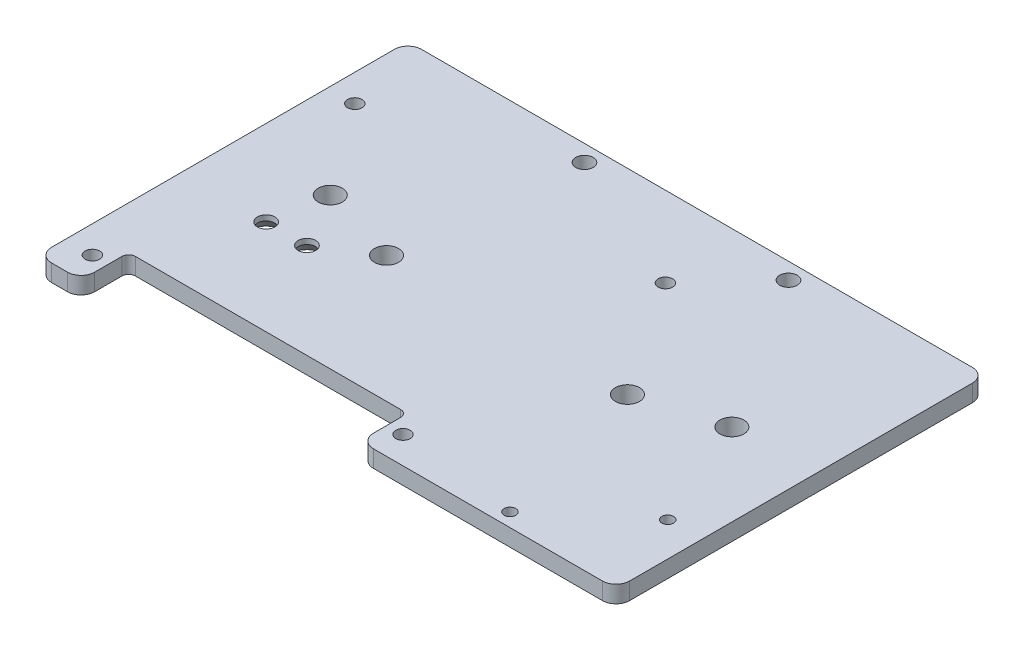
ISO-10303-21;
HEADER;
FILE_DESCRIPTION(('STEP AP214'),'2;1');
FILE_NAME('part.step','',(''),(''),'','','');
FILE_SCHEMA(('AUTOMOTIVE_DESIGN { 1 0 10303 214 1 1 1 1 }'));
ENDSEC;
DATA;
#1=APPLICATION_CONTEXT('core data for automotive mechanical design processes');
#2=APPLICATION_PROTOCOL_DEFINITION('international standard','automotive_design',2000,#1);
#3=PRODUCT_CONTEXT('',#1,'mechanical');
#4=PRODUCT('Part','Part','',(#3));
#5=PRODUCT_RELATED_PRODUCT_CATEGORY('part','',(#4));
#6=PRODUCT_DEFINITION_FORMATION('','',#4);
#7=PRODUCT_DEFINITION_CONTEXT('part definition',#1,'design');
#8=PRODUCT_DEFINITION('design','',#6,#7);
#9=PRODUCT_DEFINITION_SHAPE('','',#8);
#10=(LENGTH_UNIT() NAMED_UNIT(*) SI_UNIT(.MILLI.,.METRE.));
#11=(NAMED_UNIT(*) PLANE_ANGLE_UNIT() SI_UNIT($,.RADIAN.));
#12=(NAMED_UNIT(*) SI_UNIT($,.STERADIAN.) SOLID_ANGLE_UNIT());
#13=UNCERTAINTY_MEASURE_WITH_UNIT(LENGTH_MEASURE(1.E-05),#10,'distance_accuracy_value','');
#14=(GEOMETRIC_REPRESENTATION_CONTEXT(3) GLOBAL_UNCERTAINTY_ASSIGNED_CONTEXT((#13)) GLOBAL_UNIT_ASSIGNED_CONTEXT((#10,
#11,#12)) REPRESENTATION_CONTEXT('',''));
#15=CARTESIAN_POINT('',(0.,0.,0.));
#16=DIRECTION('',(0.,0.,1.));
#17=DIRECTION('',(1.,0.,0.));
#18=AXIS2_PLACEMENT_3D('',#15,#16,#17);
#19=CARTESIAN_POINT('',(5.5049928,3.175,-2.54));
#20=DIRECTION('',(0.,-1.,0.));
#21=DIRECTION('',(0.,0.,-1.));
#22=AXIS2_PLACEMENT_3D('',#19,#20,#21);
#23=CYLINDRICAL_SURFACE('',#22,2.54);
#24=DIRECTION('',(0.,-1.,0.));
#25=VECTOR('',#24,1.);
#26=CARTESIAN_POINT('',(8.0449928,3.175,-2.54));
#27=LINE('',#26,#25);
#28=CARTESIAN_POINT('',(8.0449928,3.175,-2.54));
#29=VERTEX_POINT('',#28);
#30=CARTESIAN_POINT('',(8.0449928,0.,-2.54));
#31=VERTEX_POINT('',#30);
#32=EDGE_CURVE('E289',#29,#31,#27,.T.);
#33=ORIENTED_EDGE('',*,*,#32,.F.);
#34=CARTESIAN_POINT('',(5.5049928,3.175,-2.54));
#35=DIRECTION('',(0.,-1.,0.));
#36=DIRECTION('',(0.,0.,-1.));
#37=AXIS2_PLACEMENT_3D('',#34,#35,#36);
#38=CIRCLE('',#37,2.54);
#39=CARTESIAN_POINT('',(5.5049928,3.175,0.));
#40=VERTEX_POINT('',#39);
#41=EDGE_CURVE('E55',#40,#29,#38,.F.);
#42=ORIENTED_EDGE('',*,*,#41,.F.);
#43=DIRECTION('',(0.,-1.,0.));
#44=VECTOR('',#43,1.);
#45=CARTESIAN_POINT('',(5.5049928,3.175,0.));
#46=LINE('',#45,#44);
#47=CARTESIAN_POINT('',(5.5049928,0.,0.));
#48=VERTEX_POINT('',#47);
#49=EDGE_CURVE('E293',#48,#40,#46,.F.);
#50=ORIENTED_EDGE('',*,*,#49,.F.);
#51=CARTESIAN_POINT('',(5.5049928,0.,-2.54));
#52=DIRECTION('',(0.,-1.,0.));
#53=DIRECTION('',(0.,0.,-1.));
#54=AXIS2_PLACEMENT_3D('',#51,#52,#53);
#55=CIRCLE('',#54,2.54);
#56=EDGE_CURVE('E11',#31,#48,#55,.T.);
#57=ORIENTED_EDGE('',*,*,#56,.F.);
#58=EDGE_LOOP('',(#33,#42,#50,#57));
#59=FACE_BOUND('',#58,.T.);
#60=ADVANCED_FACE('F47',(#59),#23,.T.);
#61=CARTESIAN_POINT('',(9.3149928,3.175,-7.62));
#62=DIRECTION('',(0.,1.,0.));
#63=DIRECTION('',(0.,0.,1.));
#64=AXIS2_PLACEMENT_3D('',#61,#62,#63);
#65=CYLINDRICAL_SURFACE('',#64,1.27);
#66=DIRECTION('',(0.,-1.,0.));
#67=VECTOR('',#66,1.);
#68=CARTESIAN_POINT('',(9.3149928,3.175,-8.89));
#69=LINE('',#68,#67);
#70=CARTESIAN_POINT('',(9.3149928,3.175,-8.89));
#71=VERTEX_POINT('',#70);
#72=CARTESIAN_POINT('',(9.3149928,0.,-8.89));
#73=VERTEX_POINT('',#72);
#74=EDGE_CURVE('E274',#71,#73,#69,.T.);
#75=ORIENTED_EDGE('',*,*,#74,.F.);
#76=CARTESIAN_POINT('',(9.3149928,3.175,-7.62));
#77=DIRECTION('',(0.,-1.,0.));
#78=DIRECTION('',(0.,0.,-1.));
#79=AXIS2_PLACEMENT_3D('',#76,#77,#78);
#80=CIRCLE('',#79,1.27);
#81=CARTESIAN_POINT('',(8.0449928,3.175,-7.62));
#82=VERTEX_POINT('',#81);
#83=EDGE_CURVE('E282',#71,#82,#80,.F.);
#84=ORIENTED_EDGE('',*,*,#83,.T.);
#85=DIRECTION('',(0.,-1.,0.));
#86=VECTOR('',#85,1.);
#87=CARTESIAN_POINT('',(8.0449928,3.175,-7.62));
#88=LINE('',#87,#86);
#89=CARTESIAN_POINT('',(8.0449928,0.,-7.62));
#90=VERTEX_POINT('',#89);
#91=EDGE_CURVE('E278',#90,#82,#88,.F.);
#92=ORIENTED_EDGE('',*,*,#91,.F.);
#93=CARTESIAN_POINT('',(9.3149928,0.,-7.62));
#94=DIRECTION('',(0.,-1.,0.));
#95=DIRECTION('',(0.,0.,-1.));
#96=AXIS2_PLACEMENT_3D('',#93,#94,#95);
#97=CIRCLE('',#96,1.27);
#98=EDGE_CURVE('E286',#90,#73,#97,.T.);
#99=ORIENTED_EDGE('',*,*,#98,.T.);
#100=EDGE_LOOP('',(#75,#84,#92,#99));
#101=FACE_BOUND('',#100,.T.);
#102=ADVANCED_FACE('F619',(#101),#65,.F.);
#103=CARTESIAN_POINT('',(58.845007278,3.175,-7.62));
#104=DIRECTION('',(0.,1.,0.));
#105=DIRECTION('',(0.,0.,1.));
#106=AXIS2_PLACEMENT_3D('',#103,#104,#105);
#107=CYLINDRICAL_SURFACE('',#106,1.27);
#108=DIRECTION('',(0.,-1.,0.));
#109=VECTOR('',#108,1.);
#110=CARTESIAN_POINT('',(60.115007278,3.175,-7.62));
#111=LINE('',#110,#109);
#112=CARTESIAN_POINT('',(60.115007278,3.175,-7.62));
#113=VERTEX_POINT('',#112);
#114=CARTESIAN_POINT('',(60.115007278,0.,-7.62));
#115=VERTEX_POINT('',#114);
#116=EDGE_CURVE('E259',#113,#115,#111,.T.);
#117=ORIENTED_EDGE('',*,*,#116,.F.);
#118=CARTESIAN_POINT('',(58.845007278,3.175,-7.62));
#119=DIRECTION('',(0.,-1.,0.));
#120=DIRECTION('',(0.,0.,-1.));
#121=AXIS2_PLACEMENT_3D('',#118,#119,#120);
#122=CIRCLE('',#121,1.27);
#123=CARTESIAN_POINT('',(58.845007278,3.175,-8.89));
#124=VERTEX_POINT('',#123);
#125=EDGE_CURVE('E267',#113,#124,#122,.F.);
#126=ORIENTED_EDGE('',*,*,#125,.T.);
#127=DIRECTION('',(0.,-1.,0.));
#128=VECTOR('',#127,1.);
#129=CARTESIAN_POINT('',(58.845007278,3.175,-8.89));
#130=LINE('',#129,#128);
#131=CARTESIAN_POINT('',(58.845007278,0.,-8.89));
#132=VERTEX_POINT('',#131);
#133=EDGE_CURVE('E263',#132,#124,#130,.F.);
#134=ORIENTED_EDGE('',*,*,#133,.F.);
#135=CARTESIAN_POINT('',(58.845007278,0.,-7.62));
#136=DIRECTION('',(0.,-1.,0.));
#137=DIRECTION('',(0.,0.,-1.));
#138=AXIS2_PLACEMENT_3D('',#135,#136,#137);
#139=CIRCLE('',#138,1.27);
#140=EDGE_CURVE('E271',#132,#115,#139,.T.);
#141=ORIENTED_EDGE('',*,*,#140,.T.);
#142=EDGE_LOOP('',(#117,#126,#134,#141));
#143=FACE_BOUND('',#142,.T.);
#144=ADVANCED_FACE('F624',(#143),#107,.F.);
#145=CARTESIAN_POINT('',(62.655007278,3.175,-2.54));
#146=DIRECTION('',(0.,1.,0.));
#147=DIRECTION('',(0.,0.,1.));
#148=AXIS2_PLACEMENT_3D('',#145,#146,#147);
#149=CYLINDRICAL_SURFACE('',#148,2.54);
#150=DIRECTION('',(0.,1.,0.));
#151=VECTOR('',#150,1.);
#152=CARTESIAN_POINT('',(60.115007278,3.175,-2.54));
#153=LINE('',#152,#151);
#154=CARTESIAN_POINT('',(60.115007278,0.,-2.54));
#155=VERTEX_POINT('',#154);
#156=CARTESIAN_POINT('',(60.115007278,3.175,-2.54));
#157=VERTEX_POINT('',#156);
#158=EDGE_CURVE('E244',#155,#157,#153,.T.);
#159=ORIENTED_EDGE('',*,*,#158,.F.);
#160=CARTESIAN_POINT('',(62.655007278,0.,-2.54));
#161=DIRECTION('',(0.,-1.,0.));
#162=DIRECTION('',(0.,0.,-1.));
#163=AXIS2_PLACEMENT_3D('',#160,#161,#162);
#164=CIRCLE('',#163,2.54);
#165=CARTESIAN_POINT('',(62.655007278,0.,0.));
#166=VERTEX_POINT('',#165);
#167=EDGE_CURVE('E252',#166,#155,#164,.T.);
#168=ORIENTED_EDGE('',*,*,#167,.F.);
#169=DIRECTION('',(0.,1.,0.));
#170=VECTOR('',#169,1.);
#171=CARTESIAN_POINT('',(62.655007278,3.175,0.));
#172=LINE('',#171,#170);
#173=CARTESIAN_POINT('',(62.655007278,3.175,0.));
#174=VERTEX_POINT('',#173);
#175=EDGE_CURVE('E248',#174,#166,#172,.F.);
#176=ORIENTED_EDGE('',*,*,#175,.F.);
#177=CARTESIAN_POINT('',(62.655007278,3.175,-2.54));
#178=DIRECTION('',(0.,-1.,0.));
#179=DIRECTION('',(0.,0.,-1.));
#180=AXIS2_PLACEMENT_3D('',#177,#178,#179);
#181=CIRCLE('',#180,2.54);
#182=EDGE_CURVE('E256',#157,#174,#181,.F.);
#183=ORIENTED_EDGE('',*,*,#182,.F.);
#184=EDGE_LOOP('',(#159,#168,#176,#183));
#185=FACE_BOUND('',#184,.T.);
#186=ADVANCED_FACE('F630',(#185),#149,.T.);
#187=CARTESIAN_POINT('',(105.41,3.175,-2.54));
#188=DIRECTION('',(0.,-1.,0.));
#189=DIRECTION('',(0.,0.,-1.));
#190=AXIS2_PLACEMENT_3D('',#187,#188,#189);
#191=CYLINDRICAL_SURFACE('',#190,2.54);
#192=DIRECTION('',(0.,-1.,0.));
#193=VECTOR('',#192,1.);
#194=CARTESIAN_POINT('',(107.95,3.175,-2.54));
#195=LINE('',#194,#193);
#196=CARTESIAN_POINT('',(107.95,3.175,-2.54));
#197=VERTEX_POINT('',#196);
#198=CARTESIAN_POINT('',(107.95,0.,-2.54));
#199=VERTEX_POINT('',#198);
#200=EDGE_CURVE('E229',#197,#199,#195,.T.);
#201=ORIENTED_EDGE('',*,*,#200,.F.);
#202=CARTESIAN_POINT('',(105.41,3.175,-2.54));
#203=DIRECTION('',(0.,-1.,0.));
#204=DIRECTION('',(0.,0.,-1.));
#205=AXIS2_PLACEMENT_3D('',#202,#203,#204);
#206=CIRCLE('',#205,2.54);
#207=CARTESIAN_POINT('',(105.41,3.175,0.));
#208=VERTEX_POINT('',#207);
#209=EDGE_CURVE('E237',#208,#197,#206,.F.);
#210=ORIENTED_EDGE('',*,*,#209,.F.);
#211=DIRECTION('',(0.,-1.,0.));
#212=VECTOR('',#211,1.);
#213=CARTESIAN_POINT('',(105.41,3.175,0.));
#214=LINE('',#213,#212);
#215=CARTESIAN_POINT('',(105.41,0.,0.));
#216=VERTEX_POINT('',#215);
#217=EDGE_CURVE('E233',#216,#208,#214,.F.);
#218=ORIENTED_EDGE('',*,*,#217,.F.);
#219=CARTESIAN_POINT('',(105.41,0.,-2.54));
#220=DIRECTION('',(0.,-1.,0.));
#221=DIRECTION('',(0.,0.,-1.));
#222=AXIS2_PLACEMENT_3D('',#219,#220,#221);
#223=CIRCLE('',#222,2.54);
#224=EDGE_CURVE('E240',#199,#216,#223,.T.);
#225=ORIENTED_EDGE('',*,*,#224,.F.);
#226=EDGE_LOOP('',(#201,#210,#218,#225));
#227=FACE_BOUND('',#226,.T.);
#228=ADVANCED_FACE('F424',(#227),#191,.T.);
#229=CARTESIAN_POINT('',(105.41,3.175,-66.548));
#230=DIRECTION('',(0.,1.,0.));
#231=DIRECTION('',(0.,0.,1.));
#232=AXIS2_PLACEMENT_3D('',#229,#230,#231);
#233=CYLINDRICAL_SURFACE('',#232,2.54);
#234=DIRECTION('',(0.,1.,0.));
#235=VECTOR('',#234,1.);
#236=CARTESIAN_POINT('',(107.95,3.175,-66.548));
#237=LINE('',#236,#235);
#238=CARTESIAN_POINT('',(107.95,0.,-66.548));
#239=VERTEX_POINT('',#238);
#240=CARTESIAN_POINT('',(107.95,3.175,-66.548));
#241=VERTEX_POINT('',#240);
#242=EDGE_CURVE('E214',#239,#241,#237,.T.);
#243=ORIENTED_EDGE('',*,*,#242,.F.);
#244=CARTESIAN_POINT('',(105.41,0.,-66.548));
#245=DIRECTION('',(0.,-1.,0.));
#246=DIRECTION('',(0.,0.,-1.));
#247=AXIS2_PLACEMENT_3D('',#244,#245,#246);
#248=CIRCLE('',#247,2.54);
#249=CARTESIAN_POINT('',(105.41,0.,-69.088));
#250=VERTEX_POINT('',#249);
#251=EDGE_CURVE('E222',#250,#239,#248,.T.);
#252=ORIENTED_EDGE('',*,*,#251,.F.);
#253=DIRECTION('',(0.,1.,0.));
#254=VECTOR('',#253,1.);
#255=CARTESIAN_POINT('',(105.41,3.175,-69.088));
#256=LINE('',#255,#254);
#257=CARTESIAN_POINT('',(105.41,3.175,-69.088));
#258=VERTEX_POINT('',#257);
#259=EDGE_CURVE('E218',#258,#250,#256,.F.);
#260=ORIENTED_EDGE('',*,*,#259,.F.);
#261=CARTESIAN_POINT('',(105.41,3.175,-66.548));
#262=DIRECTION('',(0.,-1.,0.));
#263=DIRECTION('',(0.,0.,-1.));
#264=AXIS2_PLACEMENT_3D('',#261,#262,#263);
#265=CIRCLE('',#264,2.54);
#266=EDGE_CURVE('E226',#241,#258,#265,.F.);
#267=ORIENTED_EDGE('',*,*,#266,.F.);
#268=EDGE_LOOP('',(#243,#252,#260,#267));
#269=FACE_BOUND('',#268,.T.);
#270=ADVANCED_FACE('F418',(#269),#233,.T.);
#271=CARTESIAN_POINT('',(2.54,3.175,-66.548));
#272=DIRECTION('',(0.,1.,0.));
#273=DIRECTION('',(0.,0.,1.));
#274=AXIS2_PLACEMENT_3D('',#271,#272,#273);
#275=CYLINDRICAL_SURFACE('',#274,2.54);
#276=DIRECTION('',(0.,1.,0.));
#277=VECTOR('',#276,1.);
#278=CARTESIAN_POINT('',(2.54,3.175,-69.088));
#279=LINE('',#278,#277);
#280=CARTESIAN_POINT('',(2.54,0.,-69.088));
#281=VERTEX_POINT('',#280);
#282=CARTESIAN_POINT('',(2.54,3.175,-69.088));
#283=VERTEX_POINT('',#282);
#284=EDGE_CURVE('E202',#281,#283,#279,.T.);
#285=ORIENTED_EDGE('',*,*,#284,.F.);
#286=CARTESIAN_POINT('',(2.54,0.,-66.548));
#287=DIRECTION('',(0.,-1.,0.));
#288=DIRECTION('',(0.,0.,-1.));
#289=AXIS2_PLACEMENT_3D('',#286,#287,#288);
#290=CIRCLE('',#289,2.54);
#291=CARTESIAN_POINT('',(0.,0.,-66.548));
#292=VERTEX_POINT('',#291);
#293=EDGE_CURVE('E208',#292,#281,#290,.T.);
#294=ORIENTED_EDGE('',*,*,#293,.F.);
#295=DIRECTION('',(0.,1.,0.));
#296=VECTOR('',#295,1.);
#297=CARTESIAN_POINT('',(0.,3.175,-66.548));
#298=LINE('',#297,#296);
#299=CARTESIAN_POINT('',(0.,3.175,-66.548));
#300=VERTEX_POINT('',#299);
#301=EDGE_CURVE('E166',#300,#292,#298,.F.);
#302=ORIENTED_EDGE('',*,*,#301,.F.);
#303=CARTESIAN_POINT('',(2.54,3.175,-66.548));
#304=DIRECTION('',(0.,-1.,0.));
#305=DIRECTION('',(0.,0.,-1.));
#306=AXIS2_PLACEMENT_3D('',#303,#304,#305);
#307=CIRCLE('',#306,2.54);
#308=EDGE_CURVE('E211',#283,#300,#307,.F.);
#309=ORIENTED_EDGE('',*,*,#308,.F.);
#310=EDGE_LOOP('',(#285,#294,#302,#309));
#311=FACE_BOUND('',#310,.T.);
#312=ADVANCED_FACE('F413',(#311),#275,.T.);
#313=CARTESIAN_POINT('',(2.54,3.175,-2.54));
#314=DIRECTION('',(0.,1.,0.));
#315=DIRECTION('',(0.,0.,1.));
#316=AXIS2_PLACEMENT_3D('',#313,#314,#315);
#317=CYLINDRICAL_SURFACE('',#316,2.54);
#318=DIRECTION('',(0.,1.,0.));
#319=VECTOR('',#318,1.);
#320=CARTESIAN_POINT('',(0.,3.175,-2.54));
#321=LINE('',#320,#319);
#322=CARTESIAN_POINT('',(0.,0.,-2.54));
#323=VERTEX_POINT('',#322);
#324=CARTESIAN_POINT('',(0.,3.175,-2.54));
#325=VERTEX_POINT('',#324);
#326=EDGE_CURVE('E164',#323,#325,#321,.T.);
#327=ORIENTED_EDGE('',*,*,#326,.F.);
#328=CARTESIAN_POINT('',(2.54,0.,-2.54));
#329=DIRECTION('',(0.,-1.,0.));
#330=DIRECTION('',(0.,0.,-1.));
#331=AXIS2_PLACEMENT_3D('',#328,#329,#330);
#332=CIRCLE('',#331,2.54);
#333=CARTESIAN_POINT('',(2.54,0.,0.));
#334=VERTEX_POINT('',#333);
#335=EDGE_CURVE('E172',#334,#323,#332,.T.);
#336=ORIENTED_EDGE('',*,*,#335,.F.);
#337=DIRECTION('',(0.,1.,0.));
#338=VECTOR('',#337,1.);
#339=CARTESIAN_POINT('',(2.54,3.175,0.));
#340=LINE('',#339,#338);
#341=CARTESIAN_POINT('',(2.54,3.175,0.));
#342=VERTEX_POINT('',#341);
#343=EDGE_CURVE('E182',#342,#334,#340,.F.);
#344=ORIENTED_EDGE('',*,*,#343,.F.);
#345=CARTESIAN_POINT('',(2.54,3.175,-2.54));
#346=DIRECTION('',(0.,-1.,0.));
#347=DIRECTION('',(0.,0.,-1.));
#348=AXIS2_PLACEMENT_3D('',#345,#346,#347);
#349=CIRCLE('',#348,2.54);
#350=EDGE_CURVE('E181',#325,#342,#349,.F.);
#351=ORIENTED_EDGE('',*,*,#350,.F.);
#352=EDGE_LOOP('',(#327,#336,#344,#351));
#353=FACE_BOUND('',#352,.T.);
#354=ADVANCED_FACE('F185',(#353),#317,.T.);
#355=CARTESIAN_POINT('',(0.,3.175,0.));
#356=DIRECTION('',(0.,0.,-1.));
#357=DIRECTION('',(-1.,0.,0.));
#358=AXIS2_PLACEMENT_3D('',#355,#356,#357);
#359=PLANE('',#358);
#360=DIRECTION('',(1.,0.,0.));
#361=VECTOR('',#360,1.);
#362=CARTESIAN_POINT('',(0.,0.,0.));
#363=LINE('',#362,#361);
#364=EDGE_CURVE('E176',#334,#48,#363,.T.);
#365=ORIENTED_EDGE('',*,*,#364,.T.);
#366=ORIENTED_EDGE('',*,*,#49,.T.);
#367=DIRECTION('',(1.,0.,0.));
#368=VECTOR('',#367,1.);
#369=CARTESIAN_POINT('',(0.,3.175,0.));
#370=LINE('',#369,#368);
#371=EDGE_CURVE('E305',#342,#40,#370,.T.);
#372=ORIENTED_EDGE('',*,*,#371,.F.);
#373=ORIENTED_EDGE('',*,*,#343,.T.);
#374=EDGE_LOOP('',(#365,#366,#372,#373));
#375=FACE_BOUND('',#374,.T.);
#376=ADVANCED_FACE('F646',(#375),#359,.F.);
#377=CARTESIAN_POINT('',(0.,3.175,0.));
#378=DIRECTION('',(1.,0.,0.));
#379=DIRECTION('',(0.,0.,-1.));
#380=AXIS2_PLACEMENT_3D('',#377,#378,#379);
#381=PLANE('',#380);
#382=DIRECTION('',(0.,0.,1.));
#383=VECTOR('',#382,1.);
#384=CARTESIAN_POINT('',(0.,3.175,0.));
#385=LINE('',#384,#383);
#386=EDGE_CURVE('E387',#300,#325,#385,.T.);
#387=ORIENTED_EDGE('',*,*,#386,.F.);
#388=ORIENTED_EDGE('',*,*,#301,.T.);
#389=DIRECTION('',(0.,0.,1.));
#390=VECTOR('',#389,1.);
#391=CARTESIAN_POINT('',(0.,0.,0.));
#392=LINE('',#391,#390);
#393=EDGE_CURVE('E159',#292,#323,#392,.T.);
#394=ORIENTED_EDGE('',*,*,#393,.T.);
#395=ORIENTED_EDGE('',*,*,#326,.T.);
#396=EDGE_LOOP('',(#387,#388,#394,#395));
#397=FACE_BOUND('',#396,.T.);
#398=ADVANCED_FACE('F162',(#397),#381,.F.);
#399=EDGE_CURVE('E390',#174,#208,#370,.T.);
#400=ORIENTED_EDGE('',*,*,#399,.F.);
#401=ORIENTED_EDGE('',*,*,#175,.T.);
#402=EDGE_CURVE('E169',#166,#216,#363,.T.);
#403=ORIENTED_EDGE('',*,*,#402,.T.);
#404=ORIENTED_EDGE('',*,*,#217,.T.);
#405=EDGE_LOOP('',(#400,#401,#403,#404));
#406=FACE_BOUND('',#405,.T.);
#407=ADVANCED_FACE('F427',(#406),#359,.F.);
#408=CARTESIAN_POINT('',(107.95,3.175,0.));
#409=DIRECTION('',(-1.,0.,0.));
#410=DIRECTION('',(0.,0.,1.));
#411=AXIS2_PLACEMENT_3D('',#408,#409,#410);
#412=PLANE('',#411);
#413=DIRECTION('',(0.,0.,-1.));
#414=VECTOR('',#413,1.);
#415=CARTESIAN_POINT('',(107.95,3.175,0.));
#416=LINE('',#415,#414);
#417=EDGE_CURVE('E194',#197,#241,#416,.T.);
#418=ORIENTED_EDGE('',*,*,#417,.F.);
#419=ORIENTED_EDGE('',*,*,#200,.T.);
#420=DIRECTION('',(0.,0.,-1.));
#421=VECTOR('',#420,1.);
#422=CARTESIAN_POINT('',(107.95,0.,0.));
#423=LINE('',#422,#421);
#424=EDGE_CURVE('E396',#199,#239,#423,.T.);
#425=ORIENTED_EDGE('',*,*,#424,.T.);
#426=ORIENTED_EDGE('',*,*,#242,.T.);
#427=EDGE_LOOP('',(#418,#419,#425,#426));
#428=FACE_BOUND('',#427,.T.);
#429=ADVANCED_FACE('F651',(#428),#412,.F.);
#430=CARTESIAN_POINT('',(0.,3.175,-69.088));
#431=DIRECTION('',(0.,0.,1.));
#432=DIRECTION('',(1.,0.,0.));
#433=AXIS2_PLACEMENT_3D('',#430,#431,#432);
#434=PLANE('',#433);
#435=DIRECTION('',(-1.,0.,0.));
#436=VECTOR('',#435,1.);
#437=CARTESIAN_POINT('',(0.,3.175,-69.088));
#438=LINE('',#437,#436);
#439=EDGE_CURVE('E187',#258,#283,#438,.T.);
#440=ORIENTED_EDGE('',*,*,#439,.F.);
#441=ORIENTED_EDGE('',*,*,#259,.T.);
#442=DIRECTION('',(-1.,0.,0.));
#443=VECTOR('',#442,1.);
#444=CARTESIAN_POINT('',(0.,0.,-69.088));
#445=LINE('',#444,#443);
#446=EDGE_CURVE('E197',#250,#281,#445,.T.);
#447=ORIENTED_EDGE('',*,*,#446,.T.);
#448=ORIENTED_EDGE('',*,*,#284,.T.);
#449=EDGE_LOOP('',(#440,#441,#447,#448));
#450=FACE_BOUND('',#449,.T.);
#451=ADVANCED_FACE('F408',(#450),#434,.F.);
#452=CARTESIAN_POINT('',(0.,3.175,0.));
#453=DIRECTION('',(0.,-1.,0.));
#454=DIRECTION('',(0.,0.,-1.));
#455=AXIS2_PLACEMENT_3D('',#452,#453,#454);
#456=PLANE('',#455);
#457=CARTESIAN_POINT('',(92.586250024,3.175,-36.991000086));
#458=DIRECTION('',(0.,-1.,0.));
#459=DIRECTION('',(0.,0.,-1.));
#460=AXIS2_PLACEMENT_3D('',#457,#458,#459);
#461=CIRCLE('',#460,2.25);
#462=CARTESIAN_POINT('',(92.586250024,3.175,-39.241000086));
#463=VERTEX_POINT('',#462);
#464=EDGE_CURVE('E554',#463,#463,#461,.T.);
#465=ORIENTED_EDGE('',*,*,#464,.T.);
#466=EDGE_LOOP('',(#465));
#467=FACE_BOUND('',#466,.T.);
#468=CARTESIAN_POINT('',(17.586250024,3.175,-36.991000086));
#469=DIRECTION('',(0.,-1.,0.));
#470=DIRECTION('',(0.,0.,-1.));
#471=AXIS2_PLACEMENT_3D('',#468,#469,#470);
#472=CIRCLE('',#471,2.25);
#473=CARTESIAN_POINT('',(17.586250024,3.175,-39.241000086));
#474=VERTEX_POINT('',#473);
#475=EDGE_CURVE('E542',#474,#474,#472,.T.);
#476=ORIENTED_EDGE('',*,*,#475,.T.);
#477=EDGE_LOOP('',(#476));
#478=FACE_BOUND('',#477,.T.);
#479=CARTESIAN_POINT('',(23.55230423,3.175,-26.67));
#480=DIRECTION('',(0.,-1.,0.));
#481=DIRECTION('',(0.,0.,-1.));
#482=AXIS2_PLACEMENT_3D('',#479,#480,#481);
#483=CIRCLE('',#482,1.63195);
#484=CARTESIAN_POINT('',(23.55230423,3.175,-28.30195));
#485=VERTEX_POINT('',#484);
#486=EDGE_CURVE('E524',#485,#485,#483,.T.);
#487=ORIENTED_EDGE('',*,*,#486,.T.);
#488=EDGE_LOOP('',(#487));
#489=FACE_BOUND('',#488,.T.);
#490=CARTESIAN_POINT('',(15.93230423,3.175,-26.67));
#491=DIRECTION('',(0.,-1.,0.));
#492=DIRECTION('',(0.,0.,-1.));
#493=AXIS2_PLACEMENT_3D('',#490,#491,#492);
#494=CIRCLE('',#493,1.63195);
#495=CARTESIAN_POINT('',(15.93230423,3.175,-28.30195));
#496=VERTEX_POINT('',#495);
#497=EDGE_CURVE('E507',#496,#496,#494,.T.);
#498=ORIENTED_EDGE('',*,*,#497,.T.);
#499=EDGE_LOOP('',(#498));
#500=FACE_BOUND('',#499,.T.);
#501=ORIENTED_EDGE('',*,*,#371,.T.);
#502=ORIENTED_EDGE('',*,*,#41,.T.);
#503=DIRECTION('',(0.,0.,-1.));
#504=VECTOR('',#503,1.);
#505=CARTESIAN_POINT('',(8.0449928,3.175,0.));
#506=LINE('',#505,#504);
#507=EDGE_CURVE('E303',#29,#82,#506,.T.);
#508=ORIENTED_EDGE('',*,*,#507,.T.);
#509=ORIENTED_EDGE('',*,*,#83,.F.);
#510=DIRECTION('',(1.,0.,0.));
#511=VECTOR('',#510,1.);
#512=CARTESIAN_POINT('',(8.0449928,3.175,-8.89));
#513=LINE('',#512,#511);
#514=EDGE_CURVE('E311',#71,#124,#513,.T.);
#515=ORIENTED_EDGE('',*,*,#514,.T.);
#516=ORIENTED_EDGE('',*,*,#125,.F.);
#517=DIRECTION('',(0.,0.,1.));
#518=VECTOR('',#517,1.);
#519=CARTESIAN_POINT('',(60.115007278,3.175,0.));
#520=LINE('',#519,#518);
#521=EDGE_CURVE('E319',#113,#157,#520,.T.);
#522=ORIENTED_EDGE('',*,*,#521,.T.);
#523=ORIENTED_EDGE('',*,*,#182,.T.);
#524=ORIENTED_EDGE('',*,*,#399,.T.);
#525=ORIENTED_EDGE('',*,*,#209,.T.);
#526=ORIENTED_EDGE('',*,*,#417,.T.);
#527=ORIENTED_EDGE('',*,*,#266,.T.);
#528=ORIENTED_EDGE('',*,*,#439,.T.);
#529=ORIENTED_EDGE('',*,*,#308,.T.);
#530=ORIENTED_EDGE('',*,*,#386,.T.);
#531=ORIENTED_EDGE('',*,*,#350,.T.);
#532=EDGE_LOOP('',(#501,#502,#508,#509,#515,#516,#522,#523,#524,#525,#526,#527,#528,#529,#530,#531));
#533=FACE_BOUND('',#532,.T.);
#534=CARTESIAN_POINT('',(5.08000000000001,3.175,-54.080000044));
#535=DIRECTION('',(0.,-1.,0.));
#536=DIRECTION('',(0.,0.,-1.));
#537=AXIS2_PLACEMENT_3D('',#534,#535,#536);
#538=CIRCLE('',#537,1.35);
#539=CARTESIAN_POINT('',(5.08000000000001,3.175,-55.430000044));
#540=VERTEX_POINT('',#539);
#541=EDGE_CURVE('E338',#540,#540,#538,.T.);
#542=ORIENTED_EDGE('',*,*,#541,.T.);
#543=EDGE_LOOP('',(#542));
#544=FACE_BOUND('',#543,.T.);
#545=CARTESIAN_POINT('',(77.586250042,3.175,-32.490000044));
#546=DIRECTION('',(0.,-1.,0.));
#547=DIRECTION('',(0.,0.,-1.));
#548=AXIS2_PLACEMENT_3D('',#545,#546,#547);
#549=CIRCLE('',#548,2.25);
#550=CARTESIAN_POINT('',(77.586250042,3.175,-34.740000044));
#551=VERTEX_POINT('',#550);
#552=EDGE_CURVE('E327',#551,#551,#549,.T.);
#553=ORIENTED_EDGE('',*,*,#552,.T.);
#554=EDGE_LOOP('',(#553));
#555=FACE_BOUND('',#554,.T.);
#556=CARTESIAN_POINT('',(32.586250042,3.175,-32.490000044));
#557=DIRECTION('',(0.,-1.,0.));
#558=DIRECTION('',(0.,0.,-1.));
#559=AXIS2_PLACEMENT_3D('',#556,#557,#558);
#560=CIRCLE('',#559,2.25);
#561=CARTESIAN_POINT('',(32.586250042,3.175,-34.740000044));
#562=VERTEX_POINT('',#561);
#563=EDGE_CURVE('E328',#562,#562,#560,.T.);
#564=ORIENTED_EDGE('',*,*,#563,.T.);
#565=EDGE_LOOP('',(#564));
#566=FACE_BOUND('',#565,.T.);
#567=CARTESIAN_POINT('',(74.136250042,3.175,-66.013460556));
#568=DIRECTION('',(0.,-1.,0.));
#569=DIRECTION('',(0.,0.,-1.));
#570=AXIS2_PLACEMENT_3D('',#567,#568,#569);
#571=CIRCLE('',#570,1.63195);
#572=CARTESIAN_POINT('',(74.136250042,3.175,-67.645410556));
#573=VERTEX_POINT('',#572);
#574=EDGE_CURVE('E370',#573,#573,#571,.T.);
#575=ORIENTED_EDGE('',*,*,#574,.T.);
#576=EDGE_LOOP('',(#575));
#577=FACE_BOUND('',#576,.T.);
#578=CARTESIAN_POINT('',(5.08,3.175,-5.08));
#579=DIRECTION('',(0.,-1.,0.));
#580=DIRECTION('',(0.,0.,-1.));
#581=AXIS2_PLACEMENT_3D('',#578,#579,#580);
#582=CIRCLE('',#581,1.35);
#583=CARTESIAN_POINT('',(5.08,3.175,-6.43));
#584=VERTEX_POINT('',#583);
#585=EDGE_CURVE('E353',#584,#584,#582,.T.);
#586=ORIENTED_EDGE('',*,*,#585,.T.);
#587=EDGE_LOOP('',(#586));
#588=FACE_BOUND('',#587,.T.);
#589=CARTESIAN_POINT('',(63.080000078,3.175,-5.08));
#590=DIRECTION('',(0.,-1.,0.));
#591=DIRECTION('',(0.,0.,-1.));
#592=AXIS2_PLACEMENT_3D('',#589,#590,#591);
#593=CIRCLE('',#592,1.35000000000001);
#594=CARTESIAN_POINT('',(63.080000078,3.175,-6.43000000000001));
#595=VERTEX_POINT('',#594);
#596=EDGE_CURVE('E354',#595,#595,#593,.T.);
#597=ORIENTED_EDGE('',*,*,#596,.T.);
#598=EDGE_LOOP('',(#597));
#599=FACE_BOUND('',#598,.T.);
#600=CARTESIAN_POINT('',(63.080000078,3.175,-54.080000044));
#601=DIRECTION('',(0.,-1.,0.));
#602=DIRECTION('',(0.,0.,-1.));
#603=AXIS2_PLACEMENT_3D('',#600,#601,#602);
#604=CIRCLE('',#603,1.35000000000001);
#605=CARTESIAN_POINT('',(63.080000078,3.175,-55.430000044));
#606=VERTEX_POINT('',#605);
#607=EDGE_CURVE('E337',#606,#606,#604,.T.);
#608=ORIENTED_EDGE('',*,*,#607,.T.);
#609=EDGE_LOOP('',(#608));
#610=FACE_BOUND('',#609,.T.);
#611=CARTESIAN_POINT('',(101.6,3.175,-16.002));
#612=DIRECTION('',(0.,-1.,0.));
#613=DIRECTION('',(0.,0.,-1.));
#614=AXIS2_PLACEMENT_3D('',#611,#612,#613);
#615=CIRCLE('',#614,1.09);
#616=CARTESIAN_POINT('',(101.6,3.175,-17.092));
#617=VERTEX_POINT('',#616);
#618=EDGE_CURVE('E473',#617,#617,#615,.T.);
#619=ORIENTED_EDGE('',*,*,#618,.T.);
#620=EDGE_LOOP('',(#619));
#621=FACE_BOUND('',#620,.T.);
#622=CARTESIAN_POINT('',(85.598,3.175,-2.54));
#623=DIRECTION('',(0.,-1.,0.));
#624=DIRECTION('',(0.,0.,-1.));
#625=AXIS2_PLACEMENT_3D('',#622,#623,#624);
#626=CIRCLE('',#625,1.09);
#627=CARTESIAN_POINT('',(85.598,3.175,-3.63));
#628=VERTEX_POINT('',#627);
#629=EDGE_CURVE('E485',#628,#628,#626,.T.);
#630=ORIENTED_EDGE('',*,*,#629,.T.);
#631=EDGE_LOOP('',(#630));
#632=FACE_BOUND('',#631,.T.);
#633=CARTESIAN_POINT('',(36.036250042,3.175,-66.013460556));
#634=DIRECTION('',(0.,-1.,0.));
#635=DIRECTION('',(0.,0.,-1.));
#636=AXIS2_PLACEMENT_3D('',#633,#634,#635);
#637=CIRCLE('',#636,1.63195);
#638=CARTESIAN_POINT('',(36.036250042,3.175,-67.645410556));
#639=VERTEX_POINT('',#638);
#640=EDGE_CURVE('E170',#639,#639,#637,.T.);
#641=ORIENTED_EDGE('',*,*,#640,.T.);
#642=EDGE_LOOP('',(#641));
#643=FACE_BOUND('',#642,.T.);
#644=ADVANCED_FACE('F300',(#467,#478,#489,#500,#533,#544,#555,#566,#577,#588,#599,#610,#621,
#632,#643),#456,.F.);
#645=CARTESIAN_POINT('',(0.,0.,0.));
#646=DIRECTION('',(0.,-1.,0.));
#647=DIRECTION('',(0.,0.,-1.));
#648=AXIS2_PLACEMENT_3D('',#645,#646,#647);
#649=PLANE('',#648);
#650=CARTESIAN_POINT('',(92.586250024,0.,-36.991000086));
#651=DIRECTION('',(0.,-1.,0.));
#652=DIRECTION('',(0.,0.,-1.));
#653=AXIS2_PLACEMENT_3D('',#650,#651,#652);
#654=CIRCLE('',#653,2.25);
#655=CARTESIAN_POINT('',(92.586250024,0.,-39.241000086));
#656=VERTEX_POINT('',#655);
#657=EDGE_CURVE('E560',#656,#656,#654,.T.);
#658=ORIENTED_EDGE('',*,*,#657,.F.);
#659=EDGE_LOOP('',(#658));
#660=FACE_BOUND('',#659,.T.);
#661=CARTESIAN_POINT('',(17.586250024,0.,-36.991000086));
#662=DIRECTION('',(0.,-1.,0.));
#663=DIRECTION('',(0.,0.,-1.));
#664=AXIS2_PLACEMENT_3D('',#661,#662,#663);
#665=CIRCLE('',#664,2.25);
#666=CARTESIAN_POINT('',(17.586250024,0.,-39.241000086));
#667=VERTEX_POINT('',#666);
#668=EDGE_CURVE('E548',#667,#667,#665,.T.);
#669=ORIENTED_EDGE('',*,*,#668,.F.);
#670=EDGE_LOOP('',(#669));
#671=FACE_BOUND('',#670,.T.);
#672=CARTESIAN_POINT('',(23.55230423,0.,-26.67));
#673=DIRECTION('',(0.,-1.,0.));
#674=DIRECTION('',(0.,0.,-1.));
#675=AXIS2_PLACEMENT_3D('',#672,#673,#674);
#676=CIRCLE('',#675,3.5199066);
#677=CARTESIAN_POINT('',(23.55230423,0.,-30.1899066));
#678=VERTEX_POINT('',#677);
#679=EDGE_CURVE('E536',#678,#678,#676,.T.);
#680=ORIENTED_EDGE('',*,*,#679,.F.);
#681=EDGE_LOOP('',(#680));
#682=FACE_BOUND('',#681,.T.);
#683=CARTESIAN_POINT('',(15.93230423,0.,-26.67));
#684=DIRECTION('',(0.,-1.,0.));
#685=DIRECTION('',(0.,0.,-1.));
#686=AXIS2_PLACEMENT_3D('',#683,#684,#685);
#687=CIRCLE('',#686,3.5199066);
#688=CARTESIAN_POINT('',(15.93230423,0.,-30.1899066));
#689=VERTEX_POINT('',#688);
#690=EDGE_CURVE('E518',#689,#689,#687,.T.);
#691=ORIENTED_EDGE('',*,*,#690,.F.);
#692=EDGE_LOOP('',(#691));
#693=FACE_BOUND('',#692,.T.);
#694=CARTESIAN_POINT('',(5.08000000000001,0.,-54.080000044));
#695=DIRECTION('',(0.,-1.,0.));
#696=DIRECTION('',(0.,0.,-1.));
#697=AXIS2_PLACEMENT_3D('',#694,#695,#696);
#698=CIRCLE('',#697,1.35);
#699=CARTESIAN_POINT('',(5.08000000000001,0.,-55.430000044));
#700=VERTEX_POINT('',#699);
#701=EDGE_CURVE('E333',#700,#700,#698,.T.);
#702=ORIENTED_EDGE('',*,*,#701,.F.);
#703=EDGE_LOOP('',(#702));
#704=FACE_BOUND('',#703,.T.);
#705=CARTESIAN_POINT('',(77.586250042,0.,-32.490000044));
#706=DIRECTION('',(0.,-1.,0.));
#707=DIRECTION('',(0.,0.,-1.));
#708=AXIS2_PLACEMENT_3D('',#705,#706,#707);
#709=CIRCLE('',#708,2.25);
#710=CARTESIAN_POINT('',(77.586250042,0.,-34.740000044));
#711=VERTEX_POINT('',#710);
#712=EDGE_CURVE('E342',#711,#711,#709,.T.);
#713=ORIENTED_EDGE('',*,*,#712,.F.);
#714=EDGE_LOOP('',(#713));
#715=FACE_BOUND('',#714,.T.);
#716=CARTESIAN_POINT('',(32.586250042,0.,-32.490000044));
#717=DIRECTION('',(0.,-1.,0.));
#718=DIRECTION('',(0.,0.,-1.));
#719=AXIS2_PLACEMENT_3D('',#716,#717,#718);
#720=CIRCLE('',#719,2.25);
#721=CARTESIAN_POINT('',(32.586250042,0.,-34.740000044));
#722=VERTEX_POINT('',#721);
#723=EDGE_CURVE('E323',#722,#722,#720,.T.);
#724=ORIENTED_EDGE('',*,*,#723,.F.);
#725=EDGE_LOOP('',(#724));
#726=FACE_BOUND('',#725,.T.);
#727=CARTESIAN_POINT('',(74.136250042,0.,-66.013460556));
#728=DIRECTION('',(0.,-1.,0.));
#729=DIRECTION('',(0.,0.,-1.));
#730=AXIS2_PLACEMENT_3D('',#727,#728,#729);
#731=CIRCLE('',#730,1.63195);
#732=CARTESIAN_POINT('',(74.136250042,0.,-67.645410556));
#733=VERTEX_POINT('',#732);
#734=EDGE_CURVE('E365',#733,#733,#731,.T.);
#735=ORIENTED_EDGE('',*,*,#734,.F.);
#736=EDGE_LOOP('',(#735));
#737=FACE_BOUND('',#736,.T.);
#738=CARTESIAN_POINT('',(5.08,0.,-5.08));
#739=DIRECTION('',(0.,-1.,0.));
#740=DIRECTION('',(0.,0.,-1.));
#741=AXIS2_PLACEMENT_3D('',#738,#739,#740);
#742=CIRCLE('',#741,1.35);
#743=CARTESIAN_POINT('',(5.08,0.,-6.43));
#744=VERTEX_POINT('',#743);
#745=EDGE_CURVE('E374',#744,#744,#742,.T.);
#746=ORIENTED_EDGE('',*,*,#745,.F.);
#747=EDGE_LOOP('',(#746));
#748=FACE_BOUND('',#747,.T.);
#749=CARTESIAN_POINT('',(63.080000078,0.,-5.08));
#750=DIRECTION('',(0.,-1.,0.));
#751=DIRECTION('',(0.,0.,-1.));
#752=AXIS2_PLACEMENT_3D('',#749,#750,#751);
#753=CIRCLE('',#752,1.35000000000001);
#754=CARTESIAN_POINT('',(63.080000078,0.,-6.43000000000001));
#755=VERTEX_POINT('',#754);
#756=EDGE_CURVE('E349',#755,#755,#753,.T.);
#757=ORIENTED_EDGE('',*,*,#756,.F.);
#758=EDGE_LOOP('',(#757));
#759=FACE_BOUND('',#758,.T.);
#760=CARTESIAN_POINT('',(63.080000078,0.,-54.080000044));
#761=DIRECTION('',(0.,-1.,0.));
#762=DIRECTION('',(0.,0.,-1.));
#763=AXIS2_PLACEMENT_3D('',#760,#761,#762);
#764=CIRCLE('',#763,1.35000000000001);
#765=CARTESIAN_POINT('',(63.080000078,0.,-55.430000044));
#766=VERTEX_POINT('',#765);
#767=EDGE_CURVE('E358',#766,#766,#764,.T.);
#768=ORIENTED_EDGE('',*,*,#767,.F.);
#769=EDGE_LOOP('',(#768));
#770=FACE_BOUND('',#769,.T.);
#771=CARTESIAN_POINT('',(101.6,0.,-16.002));
#772=DIRECTION('',(0.,-1.,0.));
#773=DIRECTION('',(0.,0.,-1.));
#774=AXIS2_PLACEMENT_3D('',#771,#772,#773);
#775=CIRCLE('',#774,1.09);
#776=CARTESIAN_POINT('',(101.6,0.,-17.092));
#777=VERTEX_POINT('',#776);
#778=EDGE_CURVE('E332',#777,#777,#775,.T.);
#779=ORIENTED_EDGE('',*,*,#778,.F.);
#780=EDGE_LOOP('',(#779));
#781=FACE_BOUND('',#780,.T.);
#782=CARTESIAN_POINT('',(85.598,0.,-2.54));
#783=DIRECTION('',(0.,-1.,0.));
#784=DIRECTION('',(0.,0.,-1.));
#785=AXIS2_PLACEMENT_3D('',#782,#783,#784);
#786=CIRCLE('',#785,1.09);
#787=CARTESIAN_POINT('',(85.598,0.,-3.63));
#788=VERTEX_POINT('',#787);
#789=EDGE_CURVE('E479',#788,#788,#786,.T.);
#790=ORIENTED_EDGE('',*,*,#789,.F.);
#791=EDGE_LOOP('',(#790));
#792=FACE_BOUND('',#791,.T.);
#793=DIRECTION('',(0.,0.,-1.));
#794=VECTOR('',#793,1.);
#795=CARTESIAN_POINT('',(8.0449928,0.,0.));
#796=LINE('',#795,#794);
#797=EDGE_CURVE('E491',#31,#90,#796,.T.);
#798=ORIENTED_EDGE('',*,*,#797,.F.);
#799=ORIENTED_EDGE('',*,*,#56,.T.);
#800=ORIENTED_EDGE('',*,*,#364,.F.);
#801=ORIENTED_EDGE('',*,*,#335,.T.);
#802=ORIENTED_EDGE('',*,*,#393,.F.);
#803=ORIENTED_EDGE('',*,*,#293,.T.);
#804=ORIENTED_EDGE('',*,*,#446,.F.);
#805=ORIENTED_EDGE('',*,*,#251,.T.);
#806=ORIENTED_EDGE('',*,*,#424,.F.);
#807=ORIENTED_EDGE('',*,*,#224,.T.);
#808=ORIENTED_EDGE('',*,*,#402,.F.);
#809=ORIENTED_EDGE('',*,*,#167,.T.);
#810=DIRECTION('',(0.,0.,1.));
#811=VECTOR('',#810,1.);
#812=CARTESIAN_POINT('',(60.115007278,0.,0.));
#813=LINE('',#812,#811);
#814=EDGE_CURVE('E310',#115,#155,#813,.T.);
#815=ORIENTED_EDGE('',*,*,#814,.F.);
#816=ORIENTED_EDGE('',*,*,#140,.F.);
#817=DIRECTION('',(1.,0.,0.));
#818=VECTOR('',#817,1.);
#819=CARTESIAN_POINT('',(8.0449928,0.,-8.89));
#820=LINE('',#819,#818);
#821=EDGE_CURVE('E317',#73,#132,#820,.T.);
#822=ORIENTED_EDGE('',*,*,#821,.F.);
#823=ORIENTED_EDGE('',*,*,#98,.F.);
#824=EDGE_LOOP('',(#798,#799,#800,#801,#802,#803,#804,#805,#806,#807,#808,#809,#815,#816,#822,#823));
#825=FACE_BOUND('',#824,.T.);
#826=CARTESIAN_POINT('',(36.036250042,0.,-66.013460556));
#827=DIRECTION('',(0.,-1.,0.));
#828=DIRECTION('',(0.,0.,-1.));
#829=AXIS2_PLACEMENT_3D('',#826,#827,#828);
#830=CIRCLE('',#829,1.63195);
#831=CARTESIAN_POINT('',(36.036250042,0.,-67.645410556));
#832=VERTEX_POINT('',#831);
#833=EDGE_CURVE('E369',#832,#832,#830,.T.);
#834=ORIENTED_EDGE('',*,*,#833,.F.);
#835=EDGE_LOOP('',(#834));
#836=FACE_BOUND('',#835,.T.);
#837=ADVANCED_FACE('F173',(#660,#671,#682,#693,#704,#715,#726,#737,#748,#759,#770,#781,#792,
#825,#836),#649,.T.);
#838=CARTESIAN_POINT('',(36.036250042,3.175,-66.013460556));
#839=DIRECTION('',(0.,-1.,0.));
#840=DIRECTION('',(0.,0.,-1.));
#841=AXIS2_PLACEMENT_3D('',#838,#839,#840);
#842=CYLINDRICAL_SURFACE('',#841,1.63195);
#843=ORIENTED_EDGE('',*,*,#640,.F.);
#844=EDGE_LOOP('',(#843));
#845=FACE_BOUND('',#844,.T.);
#846=ORIENTED_EDGE('',*,*,#833,.T.);
#847=EDGE_LOOP('',(#846));
#848=FACE_BOUND('',#847,.T.);
#849=ADVANCED_FACE('F573',(#845,#848),#842,.F.);
#850=CARTESIAN_POINT('',(8.0449928,3.175,0.));
#851=DIRECTION('',(-1.,0.,0.));
#852=DIRECTION('',(0.,0.,1.));
#853=AXIS2_PLACEMENT_3D('',#850,#851,#852);
#854=PLANE('',#853);
#855=ORIENTED_EDGE('',*,*,#507,.F.);
#856=ORIENTED_EDGE('',*,*,#32,.T.);
#857=ORIENTED_EDGE('',*,*,#797,.T.);
#858=ORIENTED_EDGE('',*,*,#91,.T.);
#859=EDGE_LOOP('',(#855,#856,#857,#858));
#860=FACE_BOUND('',#859,.T.);
#861=ADVANCED_FACE('F307',(#860),#854,.F.);
#862=CARTESIAN_POINT('',(60.115007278,3.175,0.));
#863=DIRECTION('',(1.,0.,0.));
#864=DIRECTION('',(0.,0.,-1.));
#865=AXIS2_PLACEMENT_3D('',#862,#863,#864);
#866=PLANE('',#865);
#867=ORIENTED_EDGE('',*,*,#521,.F.);
#868=ORIENTED_EDGE('',*,*,#116,.T.);
#869=ORIENTED_EDGE('',*,*,#814,.T.);
#870=ORIENTED_EDGE('',*,*,#158,.T.);
#871=EDGE_LOOP('',(#867,#868,#869,#870));
#872=FACE_BOUND('',#871,.T.);
#873=ADVANCED_FACE('F613',(#872),#866,.F.);
#874=CARTESIAN_POINT('',(8.0449928,3.175,-8.89));
#875=DIRECTION('',(0.,0.,-1.));
#876=DIRECTION('',(-1.,0.,0.));
#877=AXIS2_PLACEMENT_3D('',#874,#875,#876);
#878=PLANE('',#877);
#879=ORIENTED_EDGE('',*,*,#514,.F.);
#880=ORIENTED_EDGE('',*,*,#74,.T.);
#881=ORIENTED_EDGE('',*,*,#821,.T.);
#882=ORIENTED_EDGE('',*,*,#133,.T.);
#883=EDGE_LOOP('',(#879,#880,#881,#882));
#884=FACE_BOUND('',#883,.T.);
#885=ADVANCED_FACE('F602',(#884),#878,.F.);
#886=CARTESIAN_POINT('',(85.598,3.175,-2.54));
#887=DIRECTION('',(0.,-1.,0.));
#888=DIRECTION('',(0.,0.,-1.));
#889=AXIS2_PLACEMENT_3D('',#886,#887,#888);
#890=CYLINDRICAL_SURFACE('',#889,1.09);
#891=ORIENTED_EDGE('',*,*,#629,.F.);
#892=EDGE_LOOP('',(#891));
#893=FACE_BOUND('',#892,.T.);
#894=ORIENTED_EDGE('',*,*,#789,.T.);
#895=EDGE_LOOP('',(#894));
#896=FACE_BOUND('',#895,.T.);
#897=ADVANCED_FACE('F599',(#893,#896),#890,.F.);
#898=CARTESIAN_POINT('',(101.6,3.175,-16.002));
#899=DIRECTION('',(0.,-1.,0.));
#900=DIRECTION('',(0.,0.,-1.));
#901=AXIS2_PLACEMENT_3D('',#898,#899,#900);
#902=CYLINDRICAL_SURFACE('',#901,1.09);
#903=ORIENTED_EDGE('',*,*,#618,.F.);
#904=EDGE_LOOP('',(#903));
#905=FACE_BOUND('',#904,.T.);
#906=ORIENTED_EDGE('',*,*,#778,.T.);
#907=EDGE_LOOP('',(#906));
#908=FACE_BOUND('',#907,.T.);
#909=ADVANCED_FACE('F601',(#905,#908),#902,.F.);
#910=CARTESIAN_POINT('',(63.080000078,3.175,-54.080000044));
#911=DIRECTION('',(0.,-1.,0.));
#912=DIRECTION('',(0.,0.,-1.));
#913=AXIS2_PLACEMENT_3D('',#910,#911,#912);
#914=CYLINDRICAL_SURFACE('',#913,1.35000000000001);
#915=ORIENTED_EDGE('',*,*,#607,.F.);
#916=EDGE_LOOP('',(#915));
#917=FACE_BOUND('',#916,.T.);
#918=ORIENTED_EDGE('',*,*,#767,.T.);
#919=EDGE_LOOP('',(#918));
#920=FACE_BOUND('',#919,.T.);
#921=ADVANCED_FACE('F609',(#917,#920),#914,.F.);
#922=CARTESIAN_POINT('',(63.080000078,3.175,-5.08));
#923=DIRECTION('',(0.,-1.,0.));
#924=DIRECTION('',(0.,0.,-1.));
#925=AXIS2_PLACEMENT_3D('',#922,#923,#924);
#926=CYLINDRICAL_SURFACE('',#925,1.35000000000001);
#927=ORIENTED_EDGE('',*,*,#596,.F.);
#928=EDGE_LOOP('',(#927));
#929=FACE_BOUND('',#928,.T.);
#930=ORIENTED_EDGE('',*,*,#756,.T.);
#931=EDGE_LOOP('',(#930));
#932=FACE_BOUND('',#931,.T.);
#933=ADVANCED_FACE('F665',(#929,#932),#926,.F.);
#934=CARTESIAN_POINT('',(5.08,3.175,-5.08));
#935=DIRECTION('',(0.,-1.,0.));
#936=DIRECTION('',(0.,0.,-1.));
#937=AXIS2_PLACEMENT_3D('',#934,#935,#936);
#938=CYLINDRICAL_SURFACE('',#937,1.35);
#939=ORIENTED_EDGE('',*,*,#585,.F.);
#940=EDGE_LOOP('',(#939));
#941=FACE_BOUND('',#940,.T.);
#942=ORIENTED_EDGE('',*,*,#745,.T.);
#943=EDGE_LOOP('',(#942));
#944=FACE_BOUND('',#943,.T.);
#945=ADVANCED_FACE('F661',(#941,#944),#938,.F.);
#946=CARTESIAN_POINT('',(74.136250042,3.175,-66.013460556));
#947=DIRECTION('',(0.,-1.,0.));
#948=DIRECTION('',(0.,0.,-1.));
#949=AXIS2_PLACEMENT_3D('',#946,#947,#948);
#950=CYLINDRICAL_SURFACE('',#949,1.63195);
#951=ORIENTED_EDGE('',*,*,#574,.F.);
#952=EDGE_LOOP('',(#951));
#953=FACE_BOUND('',#952,.T.);
#954=ORIENTED_EDGE('',*,*,#734,.T.);
#955=EDGE_LOOP('',(#954));
#956=FACE_BOUND('',#955,.T.);
#957=ADVANCED_FACE('F664',(#953,#956),#950,.F.);
#958=CARTESIAN_POINT('',(32.586250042,3.175,-32.490000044));
#959=DIRECTION('',(0.,-1.,0.));
#960=DIRECTION('',(0.,0.,-1.));
#961=AXIS2_PLACEMENT_3D('',#958,#959,#960);
#962=CYLINDRICAL_SURFACE('',#961,2.25);
#963=ORIENTED_EDGE('',*,*,#563,.F.);
#964=EDGE_LOOP('',(#963));
#965=FACE_BOUND('',#964,.T.);
#966=ORIENTED_EDGE('',*,*,#723,.T.);
#967=EDGE_LOOP('',(#966));
#968=FACE_BOUND('',#967,.T.);
#969=ADVANCED_FACE('F669',(#965,#968),#962,.F.);
#970=CARTESIAN_POINT('',(77.586250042,3.175,-32.490000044));
#971=DIRECTION('',(0.,-1.,0.));
#972=DIRECTION('',(0.,0.,-1.));
#973=AXIS2_PLACEMENT_3D('',#970,#971,#972);
#974=CYLINDRICAL_SURFACE('',#973,2.25);
#975=ORIENTED_EDGE('',*,*,#552,.F.);
#976=EDGE_LOOP('',(#975));
#977=FACE_BOUND('',#976,.T.);
#978=ORIENTED_EDGE('',*,*,#712,.T.);
#979=EDGE_LOOP('',(#978));
#980=FACE_BOUND('',#979,.T.);
#981=ADVANCED_FACE('F677',(#977,#980),#974,.F.);
#982=CARTESIAN_POINT('',(5.08000000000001,3.175,-54.080000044));
#983=DIRECTION('',(0.,-1.,0.));
#984=DIRECTION('',(0.,0.,-1.));
#985=AXIS2_PLACEMENT_3D('',#982,#983,#984);
#986=CYLINDRICAL_SURFACE('',#985,1.35);
#987=ORIENTED_EDGE('',*,*,#541,.F.);
#988=EDGE_LOOP('',(#987));
#989=FACE_BOUND('',#988,.T.);
#990=ORIENTED_EDGE('',*,*,#701,.T.);
#991=EDGE_LOOP('',(#990));
#992=FACE_BOUND('',#991,.T.);
#993=ADVANCED_FACE('F680',(#989,#992),#986,.F.);
#994=CARTESIAN_POINT('',(15.93230423,0.,-26.67));
#995=DIRECTION('',(0.,-1.,0.));
#996=DIRECTION('',(0.,0.,-1.));
#997=AXIS2_PLACEMENT_3D('',#994,#995,#996);
#998=CYLINDRICAL_SURFACE('',#997,1.63195);
#999=ORIENTED_EDGE('',*,*,#497,.F.);
#1000=EDGE_LOOP('',(#999));
#1001=FACE_BOUND('',#1000,.T.);
#1002=CARTESIAN_POINT('',(15.93230423,2.17184562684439,-26.67));
#1003=DIRECTION('',(0.,-1.,0.));
#1004=DIRECTION('',(0.,0.,-1.));
#1005=AXIS2_PLACEMENT_3D('',#1002,#1003,#1004);
#1006=CIRCLE('',#1005,1.63195);
#1007=CARTESIAN_POINT('',(15.93230423,2.17184562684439,-28.30195));
#1008=VERTEX_POINT('',#1007);
#1009=EDGE_CURVE('E512',#1008,#1008,#1006,.T.);
#1010=ORIENTED_EDGE('',*,*,#1009,.T.);
#1011=EDGE_LOOP('',(#1010));
#1012=FACE_BOUND('',#1011,.T.);
#1013=ADVANCED_FACE('F684',(#1001,#1012),#998,.F.);
#1014=CARTESIAN_POINT('',(15.93230423,0.,-26.67));
#1015=DIRECTION('',(0.,-1.,0.));
#1016=DIRECTION('',(0.,0.,-1.));
#1017=AXIS2_PLACEMENT_3D('',#1014,#1015,#1016);
#1018=CONICAL_SURFACE('',#1017,3.5199066,0.715584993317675);
#1019=ORIENTED_EDGE('',*,*,#1009,.F.);
#1020=EDGE_LOOP('',(#1019));
#1021=FACE_BOUND('',#1020,.T.);
#1022=ORIENTED_EDGE('',*,*,#690,.T.);
#1023=EDGE_LOOP('',(#1022));
#1024=FACE_BOUND('',#1023,.T.);
#1025=ADVANCED_FACE('F704',(#1021,#1024),#1018,.F.);
#1026=CARTESIAN_POINT('',(23.55230423,0.,-26.67));
#1027=DIRECTION('',(0.,-1.,0.));
#1028=DIRECTION('',(0.,0.,-1.));
#1029=AXIS2_PLACEMENT_3D('',#1026,#1027,#1028);
#1030=CYLINDRICAL_SURFACE('',#1029,1.63195);
#1031=ORIENTED_EDGE('',*,*,#486,.F.);
#1032=EDGE_LOOP('',(#1031));
#1033=FACE_BOUND('',#1032,.T.);
#1034=CARTESIAN_POINT('',(23.55230423,2.17184562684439,-26.67));
#1035=DIRECTION('',(0.,-1.,0.));
#1036=DIRECTION('',(0.,0.,-1.));
#1037=AXIS2_PLACEMENT_3D('',#1034,#1035,#1036);
#1038=CIRCLE('',#1037,1.63195);
#1039=CARTESIAN_POINT('',(23.55230423,2.17184562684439,-28.30195));
#1040=VERTEX_POINT('',#1039);
#1041=EDGE_CURVE('E530',#1040,#1040,#1038,.T.);
#1042=ORIENTED_EDGE('',*,*,#1041,.T.);
#1043=EDGE_LOOP('',(#1042));
#1044=FACE_BOUND('',#1043,.T.);
#1045=ADVANCED_FACE('F713',(#1033,#1044),#1030,.F.);
#1046=CARTESIAN_POINT('',(23.55230423,0.,-26.67));
#1047=DIRECTION('',(0.,-1.,0.));
#1048=DIRECTION('',(0.,0.,-1.));
#1049=AXIS2_PLACEMENT_3D('',#1046,#1047,#1048);
#1050=CONICAL_SURFACE('',#1049,3.5199066,0.715584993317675);
#1051=ORIENTED_EDGE('',*,*,#1041,.F.);
#1052=EDGE_LOOP('',(#1051));
#1053=FACE_BOUND('',#1052,.T.);
#1054=ORIENTED_EDGE('',*,*,#679,.T.);
#1055=EDGE_LOOP('',(#1054));
#1056=FACE_BOUND('',#1055,.T.);
#1057=ADVANCED_FACE('F722',(#1053,#1056),#1050,.F.);
#1058=CARTESIAN_POINT('',(17.586250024,0.,-36.991000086));
#1059=DIRECTION('',(0.,-1.,0.));
#1060=DIRECTION('',(0.,0.,-1.));
#1061=AXIS2_PLACEMENT_3D('',#1058,#1059,#1060);
#1062=CYLINDRICAL_SURFACE('',#1061,2.25);
#1063=ORIENTED_EDGE('',*,*,#475,.F.);
#1064=EDGE_LOOP('',(#1063));
#1065=FACE_BOUND('',#1064,.T.);
#1066=ORIENTED_EDGE('',*,*,#668,.T.);
#1067=EDGE_LOOP('',(#1066));
#1068=FACE_BOUND('',#1067,.T.);
#1069=ADVANCED_FACE('F730',(#1065,#1068),#1062,.F.);
#1070=CARTESIAN_POINT('',(92.586250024,0.,-36.991000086));
#1071=DIRECTION('',(0.,-1.,0.));
#1072=DIRECTION('',(0.,0.,-1.));
#1073=AXIS2_PLACEMENT_3D('',#1070,#1071,#1072);
#1074=CYLINDRICAL_SURFACE('',#1073,2.25);
#1075=ORIENTED_EDGE('',*,*,#464,.F.);
#1076=EDGE_LOOP('',(#1075));
#1077=FACE_BOUND('',#1076,.T.);
#1078=ORIENTED_EDGE('',*,*,#657,.T.);
#1079=EDGE_LOOP('',(#1078));
#1080=FACE_BOUND('',#1079,.T.);
#1081=ADVANCED_FACE('F569',(#1077,#1080),#1074,.F.);
#1082=CLOSED_SHELL('',(#60,#102,#144,#186,#228,#270,#312,#354,#376,#398,#407,#429,#451,#644,
#837,#849,#861,#873,#885,#897,#909,#921,#933,#945,#957,#969,#981,#993,#1013,#1025,#1045,#1057,
#1069,#1081));
#1083=MANIFOLD_SOLID_BREP('B2',#1082);
#1084=ADVANCED_BREP_SHAPE_REPRESENTATION('',(#18,#1083),#14);
#1085=SHAPE_DEFINITION_REPRESENTATION(#9,#1084);
ENDSEC;
END-ISO-10303-21;
